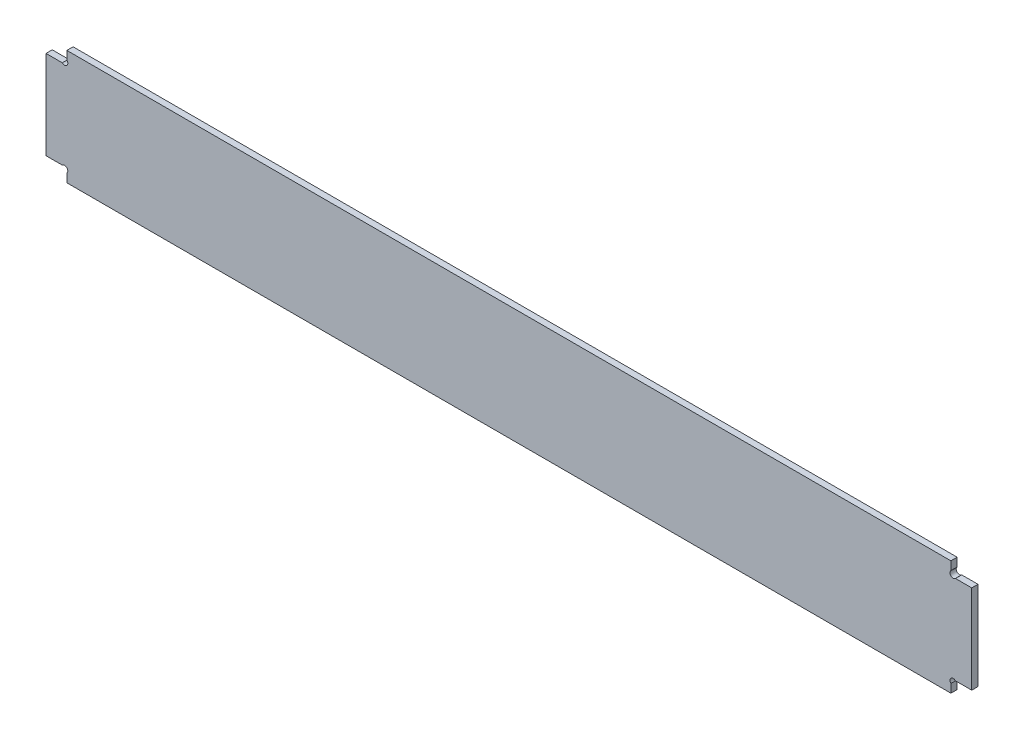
from build123d import *

# Parameters (mm, degrees)
EXTRUSION1_DEPTH = 3


with BuildPart() as part:
    # Esquisse1 → Extrusion1 (new body)
    with BuildSketch(Plane.XY):
        with BuildLine():
            Line((10, 4.057968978), (10, 0))
            Line((10, 0), (434, 0))
            Line((434, 0), (434, 4.057968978))
            ThreePointArc((434, 4.057968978), (434, 6.25), (436.192031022, 6.25))
            Line((436.192031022, 6.25), (444, 6.25))
            Line((444, 6.25), (444, 48.75))
            Line((444, 48.75), (436.192031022, 48.75))
            ThreePointArc((436.192031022, 48.75), (434, 48.75), (434, 50.942031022))
            Line((434, 50.942031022), (434, 55))
            Line((434, 55), (10, 55))
            Line((10, 55), (10, 50.942031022))
            ThreePointArc((10, 50.942031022), (10, 48.75), (7.807968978, 48.75))
            Line((7.807968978, 48.75), (0, 48.75))
            Line((0, 48.75), (0, 6.25))
            Line((0, 6.25), (7.807968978, 6.25))
            ThreePointArc((7.807968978, 6.25), (10, 6.25), (10, 4.057968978))
        make_face()
    extrude(amount=EXTRUSION1_DEPTH)


solid = part.part
